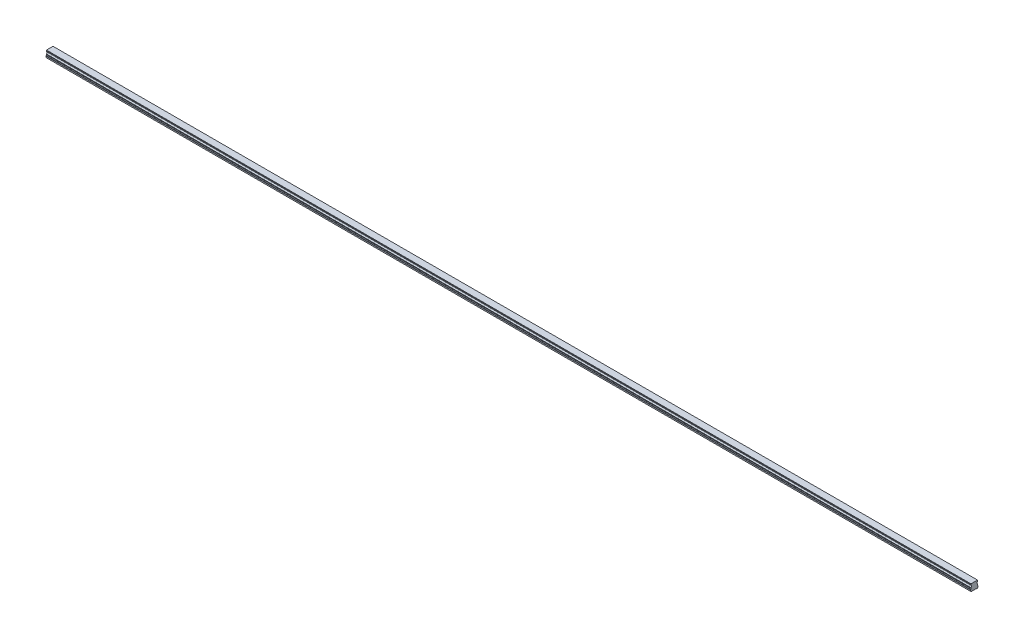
from build123d import *

# Parameters (mm, degrees)
BOSS_EXTRUDE1_DEPTH        = 1860
SKETCH3_R                  = 2.5
SKETCH3_R_2                = 2.1
CUT_EXTRUDE3_DEPTH         = 7
SKETCH3_2_R                = 2.1
CUT_EXTRUDE4_DEPTH         = 9.5
CHAMFER1_SIZE              = 0.4
LPATTERN2_COUNT            = 31
LPATTERN2_PITCH            = 60
CHAMFER1_OF_LPATTERN2_SIZE = 0.4


with BuildPart() as part:
    # Sketch1 → Boss-Extrude1 (new body)
    with BuildSketch(Plane(origin=(0, 0, 0), x_dir=(0, 0, -1), z_dir=(1, 0, 0))):
        with BuildLine():
            Line((6.59, 14), (-6.59, 14))
            Line((-6.59, 14), (-6.59, 13.15))
            Line((-6.59, 13.15), (-6.96, 12.356532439))
            Line((-6.96, 12.356532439), (-6.96, 11.435174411))
            ThreePointArc((-6.96, 11.435174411), (-5.25, 9.5), (-6.96, 7.564825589))
            Line((-6.96, 7.564825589), (-6.96, 6.643467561))
            Line((-6.96, 6.643467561), (-6.59, 5.85))
            Line((-6.59, 5.85), (-7.032116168, 4.2))
            Line((-7.032116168, 4.2), (-7.5, 3.929867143))
            Line((-7.5, 3.929867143), (-7.5, 1.4))
            Line((-7.5, 1.4), (-6.1, 0))
            Line((-6.1, 0), (-3.65, 0))
            Line((-3.65, 0), (-3.25, 0.4))
            Line((-3.25, 0.4), (3.25, 0.4))
            Line((3.25, 0.4), (3.65, 0))
            Line((3.65, 0), (6.1, 0))
            Line((6.1, 0), (7.5, 1.4))
            Line((7.5, 1.4), (7.5, 3.929867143))
            Line((7.5, 3.929867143), (7.032116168, 4.2))
            Line((7.032116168, 4.2), (6.59, 5.85))
            Line((6.59, 5.85), (6.96, 6.643467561))
            Line((6.96, 6.643467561), (6.96, 7.564825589))
            ThreePointArc((6.96, 7.564825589), (5.25, 9.5), (6.96, 11.435174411))
            Line((6.96, 11.435174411), (6.96, 12.356532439))
            Line((6.96, 12.356532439), (6.59, 13.15))
            Line((6.59, 13.15), (6.59, 14))
        make_face()
    extrude(amount=BOSS_EXTRUDE1_DEPTH)

    # Sketch3 → Cut-Extrude3 (cut)
    with BuildSketch(Plane.XZ):
        with Locations(Location((30, 0, 0), (0, 0, 270))):
            Circle(SKETCH3_R)
        with Locations(Location((30, 0, 0), (0, 0, 270))):
            Circle(SKETCH3_R_2, mode=Mode.SUBTRACT)
    cut_extrude3 = extrude(amount=-CUT_EXTRUDE3_DEPTH, mode=Mode.SUBTRACT)

    # Sketch3_2 → Cut-Extrude4 (cut)
    with BuildSketch(Plane.XZ):
        with Locations(Location((30, 0, 0), (0, 0, 270))):
            Circle(SKETCH3_2_R)
    cut_extrude4 = extrude(amount=-CUT_EXTRUDE4_DEPTH, mode=Mode.SUBTRACT)

    # Cut-Extrude5 cone 1 section (on through the dimple's axis) → Cut-Extrude5 (revolve, cut)
    with BuildSketch(Plane(origin=(30, 9.5, 0), x_dir=(0, 0, -1), z_dir=(1, 0, 0))):
        Polygon((0, 0), (2.1, 0), (0, 1.212435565), align=None)
    revolve(axis=Axis((30, 9.5, 0), (0, 1, 0)), mode=Mode.SUBTRACT)

    # Chamfer1
    chamfer1_edges = [part.edges().sort_by_distance(p)[0] for p in [
        (30, 0.4, 2.5),
    ]]
    chamfer(chamfer1_edges, length=CHAMFER1_SIZE)

    # LPattern2: Cut-Extrude3, Cut-Extrude4 ×31
    with Locations(*[(i * LPATTERN2_PITCH, 0, 0) for i in range(1, LPATTERN2_COUNT)]):
        add(cut_extrude3, mode=Mode.SUBTRACT)
        add(cut_extrude4, mode=Mode.SUBTRACT)

    # Chamfer1 of LPattern2
    chamfer1_of_lpattern2_edges = [part.edges().sort_by_distance(p)[0] for p in [
        (90, 0.4, 2.5),
        (150, 0.4, 2.5),
        (210, 0.4, 2.5),
        (270, 0.4, 2.5),
        (330, 0.4, 2.5),
        (390, 0.4, 2.5),
        (450, 0.4, 2.5),
        (510, 0.4, 2.5),
        (570, 0.4, 2.5),
        (630, 0.4, 2.5),
        (690, 0.4, 2.5),
        (750, 0.4, 2.5),
        (810, 0.4, 2.5),
        (870, 0.4, 2.5),
        (930, 0.4, 2.5),
        (990, 0.4, 2.5),
        (1050, 0.4, 2.5),
        (1110, 0.4, 2.5),
        (1170, 0.4, 2.5),
        (1230, 0.4, 2.5),
        (1290, 0.4, 2.5),
        (1350, 0.4, 2.5),
        (1410, 0.4, 2.5),
        (1470, 0.4, 2.5),
        (1530, 0.4, 2.5),
        (1590, 0.4, 2.5),
        (1650, 0.4, 2.5),
        (1710, 0.4, 2.5),
        (1770, 0.4, 2.5),
        (1830, 0.4, 2.5),
    ]]
    chamfer(chamfer1_of_lpattern2_edges, length=CHAMFER1_OF_LPATTERN2_SIZE)


solid = part.part
